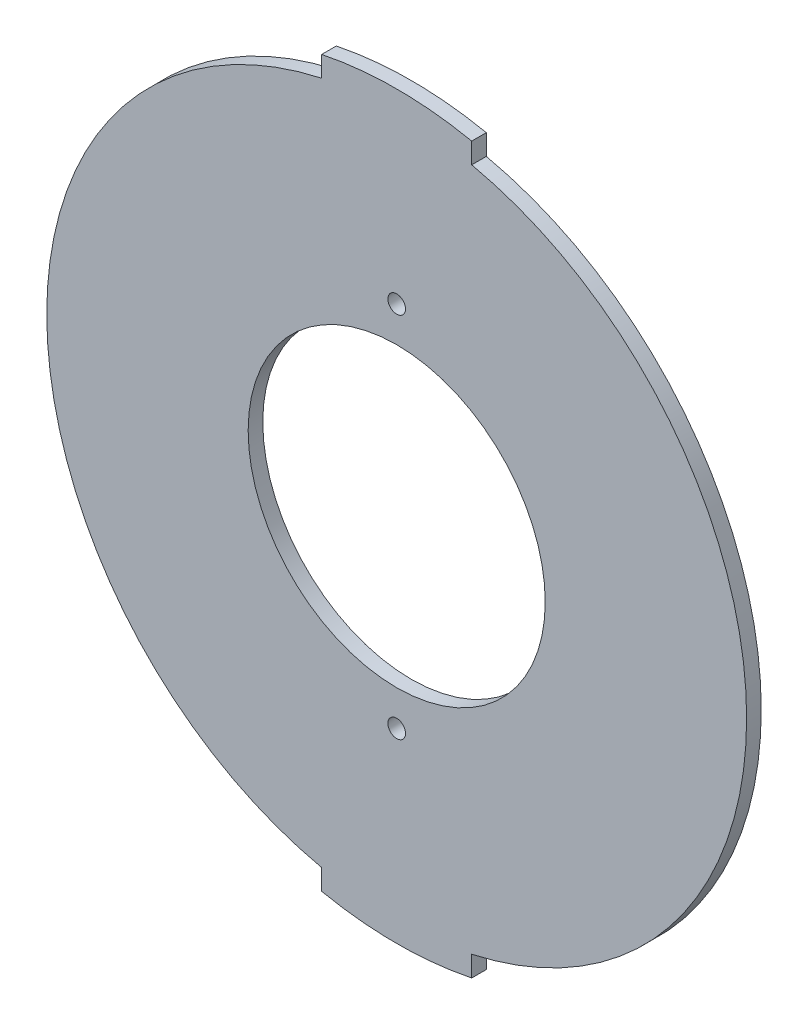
ISO-10303-21;
HEADER;
FILE_DESCRIPTION(('STEP AP214'),'2;1');
FILE_NAME('part.step','',(''),(''),'','','');
FILE_SCHEMA(('AUTOMOTIVE_DESIGN { 1 0 10303 214 1 1 1 1 }'));
ENDSEC;
DATA;
#1=APPLICATION_CONTEXT('core data for automotive mechanical design processes');
#2=APPLICATION_PROTOCOL_DEFINITION('international standard','automotive_design',2000,#1);
#3=PRODUCT_CONTEXT('',#1,'mechanical');
#4=PRODUCT('Part','Part','',(#3));
#5=PRODUCT_RELATED_PRODUCT_CATEGORY('part','',(#4));
#6=PRODUCT_DEFINITION_FORMATION('','',#4);
#7=PRODUCT_DEFINITION_CONTEXT('part definition',#1,'design');
#8=PRODUCT_DEFINITION('design','',#6,#7);
#9=PRODUCT_DEFINITION_SHAPE('','',#8);
#10=(LENGTH_UNIT() NAMED_UNIT(*) SI_UNIT(.MILLI.,.METRE.));
#11=(NAMED_UNIT(*) PLANE_ANGLE_UNIT() SI_UNIT($,.RADIAN.));
#12=(NAMED_UNIT(*) SI_UNIT($,.STERADIAN.) SOLID_ANGLE_UNIT());
#13=UNCERTAINTY_MEASURE_WITH_UNIT(LENGTH_MEASURE(1.E-05),#10,'distance_accuracy_value','');
#14=(GEOMETRIC_REPRESENTATION_CONTEXT(3) GLOBAL_UNCERTAINTY_ASSIGNED_CONTEXT((#13)) GLOBAL_UNIT_ASSIGNED_CONTEXT((#10,
#11,#12)) REPRESENTATION_CONTEXT('',''));
#15=CARTESIAN_POINT('',(0.,0.,0.));
#16=DIRECTION('',(0.,0.,1.));
#17=DIRECTION('',(1.,0.,0.));
#18=AXIS2_PLACEMENT_3D('',#15,#16,#17);
#19=CARTESIAN_POINT('',(0.,0.,2.9));
#20=DIRECTION('',(0.,0.,1.));
#21=DIRECTION('',(1.,0.,0.));
#22=AXIS2_PLACEMENT_3D('',#19,#20,#21);
#23=PLANE('',#22);
#24=CARTESIAN_POINT('',(0.,-36.5,2.9));
#25=DIRECTION('',(0.,0.,1.));
#26=DIRECTION('',(1.,0.,0.));
#27=AXIS2_PLACEMENT_3D('',#24,#25,#26);
#28=CIRCLE('',#27,1.75);
#29=CARTESIAN_POINT('',(1.75000000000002,-36.5,2.9));
#30=VERTEX_POINT('',#29);
#31=EDGE_CURVE('E547',#30,#30,#28,.T.);
#32=ORIENTED_EDGE('',*,*,#31,.F.);
#33=EDGE_LOOP('',(#32));
#34=FACE_BOUND('',#33,.T.);
#35=CARTESIAN_POINT('',(0.,0.,2.9));
#36=DIRECTION('',(0.,0.,1.));
#37=DIRECTION('',(1.,0.,0.));
#38=AXIS2_PLACEMENT_3D('',#35,#36,#37);
#39=CIRCLE('',#38,69.5);
#40=CARTESIAN_POINT('',(-14.9,67.8840187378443,2.9));
#41=VERTEX_POINT('',#40);
#42=CARTESIAN_POINT('',(-14.9,-67.8840187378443,2.9));
#43=VERTEX_POINT('',#42);
#44=EDGE_CURVE('E452',#41,#43,#39,.T.);
#45=ORIENTED_EDGE('',*,*,#44,.T.);
#46=DIRECTION('',(0.,-1.,0.));
#47=VECTOR('',#46,1.);
#48=CARTESIAN_POINT('',(-14.9,-67.8840187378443,2.9));
#49=LINE('',#48,#47);
#50=CARTESIAN_POINT('',(-14.9,-71.9738841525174,2.9));
#51=VERTEX_POINT('',#50);
#52=EDGE_CURVE('E429',#43,#51,#49,.T.);
#53=ORIENTED_EDGE('',*,*,#52,.T.);
#54=CARTESIAN_POINT('',(0.,0.,2.9));
#55=DIRECTION('',(0.,0.,1.));
#56=DIRECTION('',(1.,0.,0.));
#57=AXIS2_PLACEMENT_3D('',#54,#55,#56);
#58=CIRCLE('',#57,73.5);
#59=CARTESIAN_POINT('',(14.9,-71.9738841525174,2.9));
#60=VERTEX_POINT('',#59);
#61=EDGE_CURVE('E455',#51,#60,#58,.T.);
#62=ORIENTED_EDGE('',*,*,#61,.T.);
#63=DIRECTION('',(0.,1.,0.));
#64=VECTOR('',#63,1.);
#65=CARTESIAN_POINT('',(14.9,-67.8840187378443,2.9));
#66=LINE('',#65,#64);
#67=CARTESIAN_POINT('',(14.9,-67.8840187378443,2.9));
#68=VERTEX_POINT('',#67);
#69=EDGE_CURVE('E457',#60,#68,#66,.T.);
#70=ORIENTED_EDGE('',*,*,#69,.T.);
#71=CARTESIAN_POINT('',(0.,0.,2.9));
#72=DIRECTION('',(0.,0.,1.));
#73=DIRECTION('',(1.,0.,0.));
#74=AXIS2_PLACEMENT_3D('',#71,#72,#73);
#75=CIRCLE('',#74,69.5);
#76=CARTESIAN_POINT('',(14.9,67.8840187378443,2.9));
#77=VERTEX_POINT('',#76);
#78=EDGE_CURVE('E459',#68,#77,#75,.T.);
#79=ORIENTED_EDGE('',*,*,#78,.T.);
#80=DIRECTION('',(0.,1.,0.));
#81=VECTOR('',#80,1.);
#82=CARTESIAN_POINT('',(14.9,71.9738841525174,2.9));
#83=LINE('',#82,#81);
#84=CARTESIAN_POINT('',(14.9,71.9738841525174,2.9));
#85=VERTEX_POINT('',#84);
#86=EDGE_CURVE('E461',#77,#85,#83,.T.);
#87=ORIENTED_EDGE('',*,*,#86,.T.);
#88=CARTESIAN_POINT('',(0.,0.,2.9));
#89=DIRECTION('',(0.,0.,1.));
#90=DIRECTION('',(1.,0.,0.));
#91=AXIS2_PLACEMENT_3D('',#88,#89,#90);
#92=CIRCLE('',#91,73.5);
#93=CARTESIAN_POINT('',(-14.9,71.9738841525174,2.9));
#94=VERTEX_POINT('',#93);
#95=EDGE_CURVE('E370',#85,#94,#92,.T.);
#96=ORIENTED_EDGE('',*,*,#95,.T.);
#97=DIRECTION('',(0.,-1.,0.));
#98=VECTOR('',#97,1.);
#99=CARTESIAN_POINT('',(-14.9,71.9738841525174,2.9));
#100=LINE('',#99,#98);
#101=EDGE_CURVE('E365',#94,#41,#100,.T.);
#102=ORIENTED_EDGE('',*,*,#101,.T.);
#103=EDGE_LOOP('',(#45,#53,#62,#70,#79,#87,#96,#102));
#104=FACE_BOUND('',#103,.T.);
#105=CARTESIAN_POINT('',(0.,36.5,2.9));
#106=DIRECTION('',(0.,0.,1.));
#107=DIRECTION('',(1.,0.,0.));
#108=AXIS2_PLACEMENT_3D('',#105,#106,#107);
#109=CIRCLE('',#108,1.75);
#110=CARTESIAN_POINT('',(1.75000000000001,36.5,2.9));
#111=VERTEX_POINT('',#110);
#112=EDGE_CURVE('E434',#111,#111,#109,.T.);
#113=ORIENTED_EDGE('',*,*,#112,.F.);
#114=EDGE_LOOP('',(#113));
#115=FACE_BOUND('',#114,.T.);
#116=CARTESIAN_POINT('',(0.,0.,2.9));
#117=DIRECTION('',(0.,0.,1.));
#118=DIRECTION('',(1.,0.,0.));
#119=AXIS2_PLACEMENT_3D('',#116,#117,#118);
#120=CIRCLE('',#119,29.5);
#121=CARTESIAN_POINT('',(29.5,0.,2.9));
#122=VERTEX_POINT('',#121);
#123=EDGE_CURVE('E536',#122,#122,#120,.T.);
#124=ORIENTED_EDGE('',*,*,#123,.F.);
#125=EDGE_LOOP('',(#124));
#126=FACE_BOUND('',#125,.T.);
#127=ADVANCED_FACE('F350',(#34,#104,#115,#126),#23,.T.);
#128=CARTESIAN_POINT('',(0.,0.,0.));
#129=DIRECTION('',(0.,0.,1.));
#130=DIRECTION('',(1.,0.,0.));
#131=AXIS2_PLACEMENT_3D('',#128,#129,#130);
#132=PLANE('',#131);
#133=CARTESIAN_POINT('',(0.,-36.5,0.));
#134=DIRECTION('',(0.,0.,1.));
#135=DIRECTION('',(1.,0.,0.));
#136=AXIS2_PLACEMENT_3D('',#133,#134,#135);
#137=CIRCLE('',#136,1.75);
#138=CARTESIAN_POINT('',(1.75000000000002,-36.5,0.));
#139=VERTEX_POINT('',#138);
#140=EDGE_CURVE('E542',#139,#139,#137,.T.);
#141=ORIENTED_EDGE('',*,*,#140,.T.);
#142=EDGE_LOOP('',(#141));
#143=FACE_BOUND('',#142,.T.);
#144=CARTESIAN_POINT('',(0.,0.,0.));
#145=DIRECTION('',(0.,0.,1.));
#146=DIRECTION('',(1.,0.,0.));
#147=AXIS2_PLACEMENT_3D('',#144,#145,#146);
#148=CIRCLE('',#147,69.5);
#149=CARTESIAN_POINT('',(-14.9,67.8840187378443,0.));
#150=VERTEX_POINT('',#149);
#151=CARTESIAN_POINT('',(-14.9,-67.8840187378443,0.));
#152=VERTEX_POINT('',#151);
#153=EDGE_CURVE('E420',#150,#152,#148,.T.);
#154=ORIENTED_EDGE('',*,*,#153,.F.);
#155=DIRECTION('',(0.,-1.,0.));
#156=VECTOR('',#155,1.);
#157=CARTESIAN_POINT('',(-14.9,71.9738841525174,0.));
#158=LINE('',#157,#156);
#159=CARTESIAN_POINT('',(-14.9,71.9738841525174,0.));
#160=VERTEX_POINT('',#159);
#161=EDGE_CURVE('E450',#160,#150,#158,.T.);
#162=ORIENTED_EDGE('',*,*,#161,.F.);
#163=CARTESIAN_POINT('',(0.,0.,0.));
#164=DIRECTION('',(0.,0.,1.));
#165=DIRECTION('',(1.,0.,0.));
#166=AXIS2_PLACEMENT_3D('',#163,#164,#165);
#167=CIRCLE('',#166,73.5);
#168=CARTESIAN_POINT('',(14.9,71.9738841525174,0.));
#169=VERTEX_POINT('',#168);
#170=EDGE_CURVE('E448',#169,#160,#167,.T.);
#171=ORIENTED_EDGE('',*,*,#170,.F.);
#172=DIRECTION('',(0.,1.,0.));
#173=VECTOR('',#172,1.);
#174=CARTESIAN_POINT('',(14.9,71.9738841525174,0.));
#175=LINE('',#174,#173);
#176=CARTESIAN_POINT('',(14.9,67.8840187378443,0.));
#177=VERTEX_POINT('',#176);
#178=EDGE_CURVE('E446',#177,#169,#175,.T.);
#179=ORIENTED_EDGE('',*,*,#178,.F.);
#180=CARTESIAN_POINT('',(0.,0.,0.));
#181=DIRECTION('',(0.,0.,1.));
#182=DIRECTION('',(1.,0.,0.));
#183=AXIS2_PLACEMENT_3D('',#180,#181,#182);
#184=CIRCLE('',#183,69.5);
#185=CARTESIAN_POINT('',(14.9,-67.8840187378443,0.));
#186=VERTEX_POINT('',#185);
#187=EDGE_CURVE('E444',#186,#177,#184,.T.);
#188=ORIENTED_EDGE('',*,*,#187,.F.);
#189=DIRECTION('',(0.,1.,0.));
#190=VECTOR('',#189,1.);
#191=CARTESIAN_POINT('',(14.9,-67.8840187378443,0.));
#192=LINE('',#191,#190);
#193=CARTESIAN_POINT('',(14.9,-71.9738841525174,0.));
#194=VERTEX_POINT('',#193);
#195=EDGE_CURVE('E442',#194,#186,#192,.T.);
#196=ORIENTED_EDGE('',*,*,#195,.F.);
#197=CARTESIAN_POINT('',(0.,0.,0.));
#198=DIRECTION('',(0.,0.,1.));
#199=DIRECTION('',(1.,0.,0.));
#200=AXIS2_PLACEMENT_3D('',#197,#198,#199);
#201=CIRCLE('',#200,73.5);
#202=CARTESIAN_POINT('',(-14.9,-71.9738841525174,0.));
#203=VERTEX_POINT('',#202);
#204=EDGE_CURVE('E422',#203,#194,#201,.T.);
#205=ORIENTED_EDGE('',*,*,#204,.F.);
#206=DIRECTION('',(0.,-1.,0.));
#207=VECTOR('',#206,1.);
#208=CARTESIAN_POINT('',(-14.9,-67.8840187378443,0.));
#209=LINE('',#208,#207);
#210=EDGE_CURVE('E415',#152,#203,#209,.T.);
#211=ORIENTED_EDGE('',*,*,#210,.F.);
#212=EDGE_LOOP('',(#154,#162,#171,#179,#188,#196,#205,#211));
#213=FACE_BOUND('',#212,.T.);
#214=CARTESIAN_POINT('',(0.,36.5,0.));
#215=DIRECTION('',(0.,0.,1.));
#216=DIRECTION('',(1.,0.,0.));
#217=AXIS2_PLACEMENT_3D('',#214,#215,#216);
#218=CIRCLE('',#217,1.75);
#219=CARTESIAN_POINT('',(1.75000000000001,36.5,0.));
#220=VERTEX_POINT('',#219);
#221=EDGE_CURVE('E437',#220,#220,#218,.T.);
#222=ORIENTED_EDGE('',*,*,#221,.T.);
#223=EDGE_LOOP('',(#222));
#224=FACE_BOUND('',#223,.T.);
#225=CARTESIAN_POINT('',(0.,0.,0.));
#226=DIRECTION('',(0.,0.,1.));
#227=DIRECTION('',(1.,0.,0.));
#228=AXIS2_PLACEMENT_3D('',#225,#226,#227);
#229=CIRCLE('',#228,29.5);
#230=CARTESIAN_POINT('',(29.5,0.,0.));
#231=VERTEX_POINT('',#230);
#232=EDGE_CURVE('E539',#231,#231,#229,.T.);
#233=ORIENTED_EDGE('',*,*,#232,.T.);
#234=EDGE_LOOP('',(#233));
#235=FACE_BOUND('',#234,.T.);
#236=ADVANCED_FACE('F416',(#143,#213,#224,#235),#132,.F.);
#237=CARTESIAN_POINT('',(0.,0.,2.9));
#238=DIRECTION('',(0.,0.,-1.));
#239=DIRECTION('',(-1.,0.,0.));
#240=AXIS2_PLACEMENT_3D('',#237,#238,#239);
#241=CYLINDRICAL_SURFACE('',#240,69.5);
#242=ORIENTED_EDGE('',*,*,#153,.T.);
#243=DIRECTION('',(0.,0.,-1.));
#244=VECTOR('',#243,1.);
#245=CARTESIAN_POINT('',(-14.9,-67.8840187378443,2.9));
#246=LINE('',#245,#244);
#247=EDGE_CURVE('E11',#43,#152,#246,.T.);
#248=ORIENTED_EDGE('',*,*,#247,.F.);
#249=ORIENTED_EDGE('',*,*,#44,.F.);
#250=DIRECTION('',(0.,0.,-1.));
#251=VECTOR('',#250,1.);
#252=CARTESIAN_POINT('',(-14.9,67.8840187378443,2.9));
#253=LINE('',#252,#251);
#254=EDGE_CURVE('E433',#41,#150,#253,.T.);
#255=ORIENTED_EDGE('',*,*,#254,.T.);
#256=EDGE_LOOP('',(#242,#248,#249,#255));
#257=FACE_BOUND('',#256,.T.);
#258=ADVANCED_FACE('F352',(#257),#241,.T.);
#259=CARTESIAN_POINT('',(-14.9,-67.8840187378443,2.9));
#260=DIRECTION('',(1.,0.,0.));
#261=DIRECTION('',(0.,1.,0.));
#262=AXIS2_PLACEMENT_3D('',#259,#260,#261);
#263=PLANE('',#262);
#264=ORIENTED_EDGE('',*,*,#210,.T.);
#265=DIRECTION('',(0.,0.,-1.));
#266=VECTOR('',#265,1.);
#267=CARTESIAN_POINT('',(-14.9,-71.9738841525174,2.9));
#268=LINE('',#267,#266);
#269=EDGE_CURVE('E358',#51,#203,#268,.T.);
#270=ORIENTED_EDGE('',*,*,#269,.F.);
#271=ORIENTED_EDGE('',*,*,#52,.F.);
#272=ORIENTED_EDGE('',*,*,#247,.T.);
#273=EDGE_LOOP('',(#264,#270,#271,#272));
#274=FACE_BOUND('',#273,.T.);
#275=ADVANCED_FACE('F428',(#274),#263,.F.);
#276=CARTESIAN_POINT('',(0.,0.,2.9));
#277=DIRECTION('',(0.,0.,-1.));
#278=DIRECTION('',(-1.,0.,0.));
#279=AXIS2_PLACEMENT_3D('',#276,#277,#278);
#280=CYLINDRICAL_SURFACE('',#279,73.5);
#281=ORIENTED_EDGE('',*,*,#204,.T.);
#282=DIRECTION('',(0.,0.,-1.));
#283=VECTOR('',#282,1.);
#284=CARTESIAN_POINT('',(14.9,-71.9738841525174,2.9));
#285=LINE('',#284,#283);
#286=EDGE_CURVE('E478',#60,#194,#285,.T.);
#287=ORIENTED_EDGE('',*,*,#286,.F.);
#288=ORIENTED_EDGE('',*,*,#61,.F.);
#289=ORIENTED_EDGE('',*,*,#269,.T.);
#290=EDGE_LOOP('',(#281,#287,#288,#289));
#291=FACE_BOUND('',#290,.T.);
#292=ADVANCED_FACE('F482',(#291),#280,.T.);
#293=CARTESIAN_POINT('',(14.9,-67.8840187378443,2.9));
#294=DIRECTION('',(-1.,0.,0.));
#295=DIRECTION('',(0.,-1.,0.));
#296=AXIS2_PLACEMENT_3D('',#293,#294,#295);
#297=PLANE('',#296);
#298=ORIENTED_EDGE('',*,*,#195,.T.);
#299=DIRECTION('',(0.,0.,-1.));
#300=VECTOR('',#299,1.);
#301=CARTESIAN_POINT('',(14.9,-67.8840187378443,2.9));
#302=LINE('',#301,#300);
#303=EDGE_CURVE('E475',#68,#186,#302,.T.);
#304=ORIENTED_EDGE('',*,*,#303,.F.);
#305=ORIENTED_EDGE('',*,*,#69,.F.);
#306=ORIENTED_EDGE('',*,*,#286,.T.);
#307=EDGE_LOOP('',(#298,#304,#305,#306));
#308=FACE_BOUND('',#307,.T.);
#309=ADVANCED_FACE('F490',(#308),#297,.F.);
#310=CARTESIAN_POINT('',(0.,0.,2.9));
#311=DIRECTION('',(0.,0.,-1.));
#312=DIRECTION('',(-1.,0.,0.));
#313=AXIS2_PLACEMENT_3D('',#310,#311,#312);
#314=CYLINDRICAL_SURFACE('',#313,69.5);
#315=ORIENTED_EDGE('',*,*,#187,.T.);
#316=DIRECTION('',(0.,0.,-1.));
#317=VECTOR('',#316,1.);
#318=CARTESIAN_POINT('',(14.9,67.8840187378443,2.9));
#319=LINE('',#318,#317);
#320=EDGE_CURVE('E472',#77,#177,#319,.T.);
#321=ORIENTED_EDGE('',*,*,#320,.F.);
#322=ORIENTED_EDGE('',*,*,#78,.F.);
#323=ORIENTED_EDGE('',*,*,#303,.T.);
#324=EDGE_LOOP('',(#315,#321,#322,#323));
#325=FACE_BOUND('',#324,.T.);
#326=ADVANCED_FACE('F493',(#325),#314,.T.);
#327=CARTESIAN_POINT('',(14.9,71.9738841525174,2.9));
#328=DIRECTION('',(-1.,0.,0.));
#329=DIRECTION('',(0.,-1.,0.));
#330=AXIS2_PLACEMENT_3D('',#327,#328,#329);
#331=PLANE('',#330);
#332=ORIENTED_EDGE('',*,*,#178,.T.);
#333=DIRECTION('',(0.,0.,-1.));
#334=VECTOR('',#333,1.);
#335=CARTESIAN_POINT('',(14.9,71.9738841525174,2.9));
#336=LINE('',#335,#334);
#337=EDGE_CURVE('E469',#85,#169,#336,.T.);
#338=ORIENTED_EDGE('',*,*,#337,.F.);
#339=ORIENTED_EDGE('',*,*,#86,.F.);
#340=ORIENTED_EDGE('',*,*,#320,.T.);
#341=EDGE_LOOP('',(#332,#338,#339,#340));
#342=FACE_BOUND('',#341,.T.);
#343=ADVANCED_FACE('F498',(#342),#331,.F.);
#344=CARTESIAN_POINT('',(0.,0.,2.9));
#345=DIRECTION('',(0.,0.,-1.));
#346=DIRECTION('',(-1.,0.,0.));
#347=AXIS2_PLACEMENT_3D('',#344,#345,#346);
#348=CYLINDRICAL_SURFACE('',#347,73.5);
#349=ORIENTED_EDGE('',*,*,#170,.T.);
#350=DIRECTION('',(0.,0.,-1.));
#351=VECTOR('',#350,1.);
#352=CARTESIAN_POINT('',(-14.9,71.9738841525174,2.9));
#353=LINE('',#352,#351);
#354=EDGE_CURVE('E466',#94,#160,#353,.T.);
#355=ORIENTED_EDGE('',*,*,#354,.F.);
#356=ORIENTED_EDGE('',*,*,#95,.F.);
#357=ORIENTED_EDGE('',*,*,#337,.T.);
#358=EDGE_LOOP('',(#349,#355,#356,#357));
#359=FACE_BOUND('',#358,.T.);
#360=ADVANCED_FACE('F501',(#359),#348,.T.);
#361=CARTESIAN_POINT('',(-14.9,71.9738841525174,2.9));
#362=DIRECTION('',(1.,0.,0.));
#363=DIRECTION('',(0.,1.,0.));
#364=AXIS2_PLACEMENT_3D('',#361,#362,#363);
#365=PLANE('',#364);
#366=ORIENTED_EDGE('',*,*,#161,.T.);
#367=ORIENTED_EDGE('',*,*,#254,.F.);
#368=ORIENTED_EDGE('',*,*,#101,.F.);
#369=ORIENTED_EDGE('',*,*,#354,.T.);
#370=EDGE_LOOP('',(#366,#367,#368,#369));
#371=FACE_BOUND('',#370,.T.);
#372=ADVANCED_FACE('F503',(#371),#365,.F.);
#373=CARTESIAN_POINT('',(0.,36.5,2.9));
#374=DIRECTION('',(0.,0.,-1.));
#375=DIRECTION('',(-1.,0.,0.));
#376=AXIS2_PLACEMENT_3D('',#373,#374,#375);
#377=CYLINDRICAL_SURFACE('',#376,1.75);
#378=ORIENTED_EDGE('',*,*,#112,.T.);
#379=EDGE_LOOP('',(#378));
#380=FACE_BOUND('',#379,.T.);
#381=ORIENTED_EDGE('',*,*,#221,.F.);
#382=EDGE_LOOP('',(#381));
#383=FACE_BOUND('',#382,.T.);
#384=ADVANCED_FACE('F505',(#380,#383),#377,.F.);
#385=CARTESIAN_POINT('',(0.,-36.5,2.9));
#386=DIRECTION('',(0.,0.,-1.));
#387=DIRECTION('',(-1.,0.,0.));
#388=AXIS2_PLACEMENT_3D('',#385,#386,#387);
#389=CYLINDRICAL_SURFACE('',#388,1.75);
#390=ORIENTED_EDGE('',*,*,#31,.T.);
#391=EDGE_LOOP('',(#390));
#392=FACE_BOUND('',#391,.T.);
#393=ORIENTED_EDGE('',*,*,#140,.F.);
#394=EDGE_LOOP('',(#393));
#395=FACE_BOUND('',#394,.T.);
#396=ADVANCED_FACE('F511',(#392,#395),#389,.F.);
#397=CARTESIAN_POINT('',(0.,0.,2.9));
#398=DIRECTION('',(0.,0.,-1.));
#399=DIRECTION('',(-1.,0.,0.));
#400=AXIS2_PLACEMENT_3D('',#397,#398,#399);
#401=CYLINDRICAL_SURFACE('',#400,29.5);
#402=ORIENTED_EDGE('',*,*,#123,.T.);
#403=EDGE_LOOP('',(#402));
#404=FACE_BOUND('',#403,.T.);
#405=ORIENTED_EDGE('',*,*,#232,.F.);
#406=EDGE_LOOP('',(#405));
#407=FACE_BOUND('',#406,.T.);
#408=ADVANCED_FACE('F527',(#404,#407),#401,.F.);
#409=CLOSED_SHELL('',(#127,#236,#258,#275,#292,#309,#326,#343,#360,#372,#384,#396,#408));
#410=MANIFOLD_SOLID_BREP('B2',#409);
#411=ADVANCED_BREP_SHAPE_REPRESENTATION('',(#18,#410),#14);
#412=SHAPE_DEFINITION_REPRESENTATION(#9,#411);
ENDSEC;
END-ISO-10303-21;
